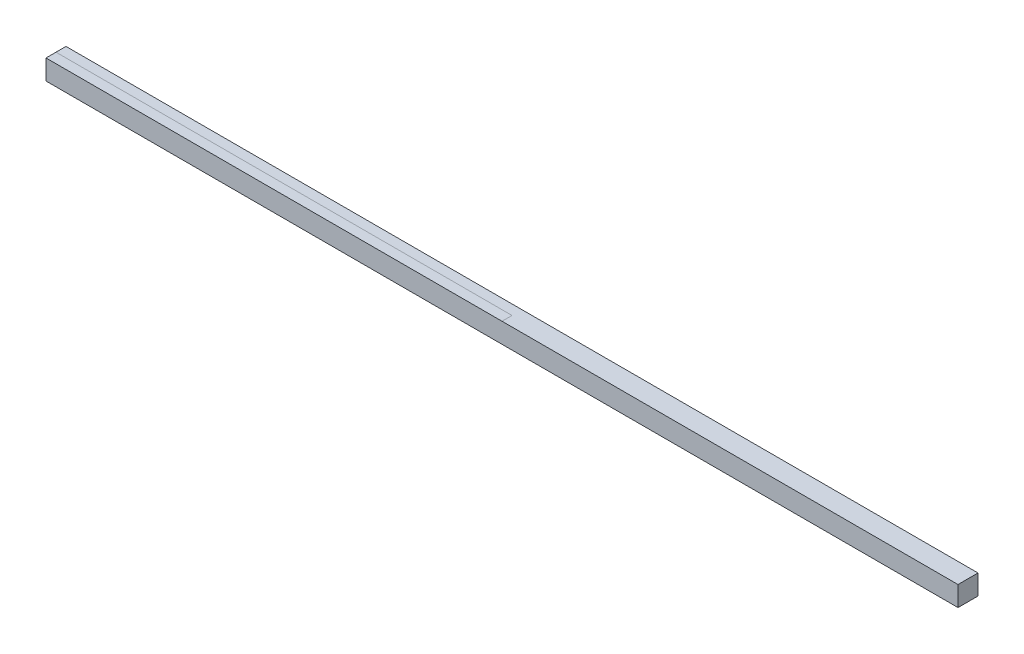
ISO-10303-21;
HEADER;
FILE_DESCRIPTION(('STEP AP214'),'2;1');
FILE_NAME('part.step','',(''),(''),'','','');
FILE_SCHEMA(('AUTOMOTIVE_DESIGN { 1 0 10303 214 1 1 1 1 }'));
ENDSEC;
DATA;
#1=APPLICATION_CONTEXT('core data for automotive mechanical design processes');
#2=APPLICATION_PROTOCOL_DEFINITION('international standard','automotive_design',2000,#1);
#3=PRODUCT_CONTEXT('',#1,'mechanical');
#4=PRODUCT('Part','Part','',(#3));
#5=PRODUCT_RELATED_PRODUCT_CATEGORY('part','',(#4));
#6=PRODUCT_DEFINITION_FORMATION('','',#4);
#7=PRODUCT_DEFINITION_CONTEXT('part definition',#1,'design');
#8=PRODUCT_DEFINITION('design','',#6,#7);
#9=PRODUCT_DEFINITION_SHAPE('','',#8);
#10=(LENGTH_UNIT() NAMED_UNIT(*) SI_UNIT(.MILLI.,.METRE.));
#11=(NAMED_UNIT(*) PLANE_ANGLE_UNIT() SI_UNIT($,.RADIAN.));
#12=(NAMED_UNIT(*) SI_UNIT($,.STERADIAN.) SOLID_ANGLE_UNIT());
#13=UNCERTAINTY_MEASURE_WITH_UNIT(LENGTH_MEASURE(1.E-05),#10,'distance_accuracy_value','');
#14=(GEOMETRIC_REPRESENTATION_CONTEXT(3) GLOBAL_UNCERTAINTY_ASSIGNED_CONTEXT((#13)) GLOBAL_UNIT_ASSIGNED_CONTEXT((#10,
#11,#12)) REPRESENTATION_CONTEXT('',''));
#15=CARTESIAN_POINT('',(0.,0.,0.));
#16=DIRECTION('',(0.,0.,1.));
#17=DIRECTION('',(1.,0.,0.));
#18=AXIS2_PLACEMENT_3D('',#15,#16,#17);
#19=CARTESIAN_POINT('',(-579.365000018,0.,12.7));
#20=DIRECTION('',(0.,1.,0.));
#21=DIRECTION('',(0.,0.,1.));
#22=AXIS2_PLACEMENT_3D('',#19,#20,#21);
#23=PLANE('',#22);
#24=DIRECTION('',(0.,0.,1.));
#25=VECTOR('',#24,1.);
#26=CARTESIAN_POINT('',(0.,0.,12.7));
#27=LINE('',#26,#25);
#28=CARTESIAN_POINT('',(0.,0.,0.));
#29=VERTEX_POINT('',#28);
#30=CARTESIAN_POINT('',(-2.22044604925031E-13,0.,12.7));
#31=VERTEX_POINT('',#30);
#32=EDGE_CURVE('E11',#29,#31,#27,.T.);
#33=ORIENTED_EDGE('',*,*,#32,.F.);
#34=DIRECTION('',(1.,0.,0.));
#35=VECTOR('',#34,1.);
#36=CARTESIAN_POINT('',(-579.365000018,0.,0.));
#37=LINE('',#36,#35);
#38=CARTESIAN_POINT('',(-579.365000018,0.,0.));
#39=VERTEX_POINT('',#38);
#40=EDGE_CURVE('E44',#39,#29,#37,.T.);
#41=ORIENTED_EDGE('',*,*,#40,.F.);
#42=DIRECTION('',(0.,0.,-1.));
#43=VECTOR('',#42,1.);
#44=CARTESIAN_POINT('',(-579.365000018,0.,12.7));
#45=LINE('',#44,#43);
#46=CARTESIAN_POINT('',(-579.365000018,0.,-12.7));
#47=VERTEX_POINT('',#46);
#48=EDGE_CURVE('E112',#39,#47,#45,.T.);
#49=ORIENTED_EDGE('',*,*,#48,.T.);
#50=DIRECTION('',(1.,0.,0.));
#51=VECTOR('',#50,1.);
#52=CARTESIAN_POINT('',(-579.365000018,0.,-12.7));
#53=LINE('',#52,#51);
#54=CARTESIAN_POINT('',(579.365000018,0.,-12.7));
#55=VERTEX_POINT('',#54);
#56=EDGE_CURVE('E150',#47,#55,#53,.T.);
#57=ORIENTED_EDGE('',*,*,#56,.T.);
#58=DIRECTION('',(0.,0.,-1.));
#59=VECTOR('',#58,1.);
#60=CARTESIAN_POINT('',(579.365000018,0.,12.7));
#61=LINE('',#60,#59);
#62=CARTESIAN_POINT('',(579.365000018,0.,12.7));
#63=VERTEX_POINT('',#62);
#64=EDGE_CURVE('E116',#63,#55,#61,.T.);
#65=ORIENTED_EDGE('',*,*,#64,.F.);
#66=DIRECTION('',(1.,0.,0.));
#67=VECTOR('',#66,1.);
#68=CARTESIAN_POINT('',(-579.365000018,0.,12.7));
#69=LINE('',#68,#67);
#70=EDGE_CURVE('E98',#31,#63,#69,.T.);
#71=ORIENTED_EDGE('',*,*,#70,.F.);
#72=EDGE_LOOP('',(#33,#41,#49,#57,#65,#71));
#73=FACE_BOUND('',#72,.T.);
#74=ADVANCED_FACE('F34',(#73),#23,.F.);
#75=CARTESIAN_POINT('',(-579.365000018,25.4000000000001,12.7));
#76=DIRECTION('',(0.,-1.,0.));
#77=DIRECTION('',(1.,0.,0.));
#78=AXIS2_PLACEMENT_3D('',#75,#76,#77);
#79=PLANE('',#78);
#80=DIRECTION('',(0.,0.,-1.));
#81=VECTOR('',#80,1.);
#82=CARTESIAN_POINT('',(0.,25.4000000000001,12.7));
#83=LINE('',#82,#81);
#84=CARTESIAN_POINT('',(-2.22044604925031E-13,25.4000000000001,12.7));
#85=VERTEX_POINT('',#84);
#86=CARTESIAN_POINT('',(0.,25.4000000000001,0.));
#87=VERTEX_POINT('',#86);
#88=EDGE_CURVE('E115',#85,#87,#83,.T.);
#89=ORIENTED_EDGE('',*,*,#88,.F.);
#90=DIRECTION('',(-1.,0.,0.));
#91=VECTOR('',#90,1.);
#92=CARTESIAN_POINT('',(-579.365000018,25.4000000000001,12.7));
#93=LINE('',#92,#91);
#94=CARTESIAN_POINT('',(579.365000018,25.4,12.7));
#95=VERTEX_POINT('',#94);
#96=EDGE_CURVE('E143',#95,#85,#93,.T.);
#97=ORIENTED_EDGE('',*,*,#96,.F.);
#98=DIRECTION('',(0.,0.,-1.));
#99=VECTOR('',#98,1.);
#100=CARTESIAN_POINT('',(579.365000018,25.4,12.7));
#101=LINE('',#100,#99);
#102=CARTESIAN_POINT('',(579.365000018,25.4,-12.7));
#103=VERTEX_POINT('',#102);
#104=EDGE_CURVE('E145',#95,#103,#101,.T.);
#105=ORIENTED_EDGE('',*,*,#104,.T.);
#106=DIRECTION('',(-1.,0.,0.));
#107=VECTOR('',#106,1.);
#108=CARTESIAN_POINT('',(-579.365000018,25.4000000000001,-12.7));
#109=LINE('',#108,#107);
#110=CARTESIAN_POINT('',(-579.365000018,25.4000000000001,-12.7));
#111=VERTEX_POINT('',#110);
#112=EDGE_CURVE('E109',#103,#111,#109,.T.);
#113=ORIENTED_EDGE('',*,*,#112,.T.);
#114=DIRECTION('',(0.,0.,-1.));
#115=VECTOR('',#114,1.);
#116=CARTESIAN_POINT('',(-579.365000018,25.4000000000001,12.7));
#117=LINE('',#116,#115);
#118=CARTESIAN_POINT('',(-579.365000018,25.4000000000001,0.));
#119=VERTEX_POINT('',#118);
#120=EDGE_CURVE('E138',#119,#111,#117,.T.);
#121=ORIENTED_EDGE('',*,*,#120,.F.);
#122=DIRECTION('',(-1.,0.,0.));
#123=VECTOR('',#122,1.);
#124=CARTESIAN_POINT('',(-579.365000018,25.4000000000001,0.));
#125=LINE('',#124,#123);
#126=EDGE_CURVE('E38',#87,#119,#125,.T.);
#127=ORIENTED_EDGE('',*,*,#126,.F.);
#128=EDGE_LOOP('',(#89,#97,#105,#113,#121,#127));
#129=FACE_BOUND('',#128,.T.);
#130=ADVANCED_FACE('F136',(#129),#79,.F.);
#131=CARTESIAN_POINT('',(-579.365000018,25.4000000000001,12.7));
#132=DIRECTION('',(1.,0.,0.));
#133=DIRECTION('',(0.,0.,-1.));
#134=AXIS2_PLACEMENT_3D('',#131,#132,#133);
#135=PLANE('',#134);
#136=DIRECTION('',(0.,-1.,0.));
#137=VECTOR('',#136,1.);
#138=CARTESIAN_POINT('',(-579.365000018,25.4000000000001,-12.7));
#139=LINE('',#138,#137);
#140=EDGE_CURVE('E152',#111,#47,#139,.T.);
#141=ORIENTED_EDGE('',*,*,#140,.T.);
#142=ORIENTED_EDGE('',*,*,#48,.F.);
#143=CARTESIAN_POINT('',(-579.365000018,0.,12.7));
#144=VERTEX_POINT('',#143);
#145=EDGE_CURVE('E95',#144,#39,#45,.T.);
#146=ORIENTED_EDGE('',*,*,#145,.F.);
#147=DIRECTION('',(0.,-1.,0.));
#148=VECTOR('',#147,1.);
#149=CARTESIAN_POINT('',(-579.365000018,25.4000000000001,12.7));
#150=LINE('',#149,#148);
#151=CARTESIAN_POINT('',(-579.365000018,25.4000000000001,12.7));
#152=VERTEX_POINT('',#151);
#153=EDGE_CURVE('E101',#152,#144,#150,.T.);
#154=ORIENTED_EDGE('',*,*,#153,.F.);
#155=EDGE_CURVE('E142',#152,#119,#117,.T.);
#156=ORIENTED_EDGE('',*,*,#155,.T.);
#157=ORIENTED_EDGE('',*,*,#120,.T.);
#158=EDGE_LOOP('',(#141,#142,#146,#154,#156,#157));
#159=FACE_BOUND('',#158,.T.);
#160=ADVANCED_FACE('F36',(#159),#135,.F.);
#161=ORIENTED_EDGE('',*,*,#40,.T.);
#162=ORIENTED_EDGE('',*,*,#32,.T.);
#163=EDGE_CURVE('E91',#144,#31,#69,.T.);
#164=ORIENTED_EDGE('',*,*,#163,.F.);
#165=ORIENTED_EDGE('',*,*,#145,.T.);
#166=EDGE_LOOP('',(#161,#162,#164,#165));
#167=FACE_BOUND('',#166,.T.);
#168=ADVANCED_FACE('F93',(#167),#23,.F.);
#169=CARTESIAN_POINT('',(579.365000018,25.4,12.7));
#170=DIRECTION('',(-1.,0.,0.));
#171=DIRECTION('',(0.,0.,1.));
#172=AXIS2_PLACEMENT_3D('',#169,#170,#171);
#173=PLANE('',#172);
#174=DIRECTION('',(0.,1.,0.));
#175=VECTOR('',#174,1.);
#176=CARTESIAN_POINT('',(579.365000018,25.4,-12.7));
#177=LINE('',#176,#175);
#178=EDGE_CURVE('E148',#55,#103,#177,.T.);
#179=ORIENTED_EDGE('',*,*,#178,.T.);
#180=ORIENTED_EDGE('',*,*,#104,.F.);
#181=DIRECTION('',(0.,1.,0.));
#182=VECTOR('',#181,1.);
#183=CARTESIAN_POINT('',(579.365000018,25.4,12.7));
#184=LINE('',#183,#182);
#185=EDGE_CURVE('E97',#63,#95,#184,.T.);
#186=ORIENTED_EDGE('',*,*,#185,.F.);
#187=ORIENTED_EDGE('',*,*,#64,.T.);
#188=EDGE_LOOP('',(#179,#180,#186,#187));
#189=FACE_BOUND('',#188,.T.);
#190=ADVANCED_FACE('F160',(#189),#173,.F.);
#191=EDGE_CURVE('E105',#85,#152,#93,.T.);
#192=ORIENTED_EDGE('',*,*,#191,.F.);
#193=ORIENTED_EDGE('',*,*,#88,.T.);
#194=ORIENTED_EDGE('',*,*,#126,.T.);
#195=ORIENTED_EDGE('',*,*,#155,.F.);
#196=EDGE_LOOP('',(#192,#193,#194,#195));
#197=FACE_BOUND('',#196,.T.);
#198=ADVANCED_FACE('F132',(#197),#79,.F.);
#199=CARTESIAN_POINT('',(-579.365000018,0.,12.7));
#200=DIRECTION('',(0.,0.,1.));
#201=DIRECTION('',(1.,0.,0.));
#202=AXIS2_PLACEMENT_3D('',#199,#200,#201);
#203=PLANE('',#202);
#204=ORIENTED_EDGE('',*,*,#153,.T.);
#205=ORIENTED_EDGE('',*,*,#163,.T.);
#206=ORIENTED_EDGE('',*,*,#70,.T.);
#207=ORIENTED_EDGE('',*,*,#185,.T.);
#208=ORIENTED_EDGE('',*,*,#96,.T.);
#209=ORIENTED_EDGE('',*,*,#191,.T.);
#210=EDGE_LOOP('',(#204,#205,#206,#207,#208,#209));
#211=FACE_BOUND('',#210,.T.);
#212=ADVANCED_FACE('F102',(#211),#203,.T.);
#213=CARTESIAN_POINT('',(-579.365000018,0.,-12.7));
#214=DIRECTION('',(0.,0.,1.));
#215=DIRECTION('',(1.,0.,0.));
#216=AXIS2_PLACEMENT_3D('',#213,#214,#215);
#217=PLANE('',#216);
#218=ORIENTED_EDGE('',*,*,#140,.F.);
#219=ORIENTED_EDGE('',*,*,#112,.F.);
#220=ORIENTED_EDGE('',*,*,#178,.F.);
#221=ORIENTED_EDGE('',*,*,#56,.F.);
#222=EDGE_LOOP('',(#218,#219,#220,#221));
#223=FACE_BOUND('',#222,.T.);
#224=ADVANCED_FACE('F163',(#223),#217,.F.);
#225=CLOSED_SHELL('',(#74,#130,#160,#168,#190,#198,#212,#224));
#226=MANIFOLD_SOLID_BREP('B2',#225);
#227=ADVANCED_BREP_SHAPE_REPRESENTATION('',(#18,#226),#14);
#228=SHAPE_DEFINITION_REPRESENTATION(#9,#227);
ENDSEC;
END-ISO-10303-21;
